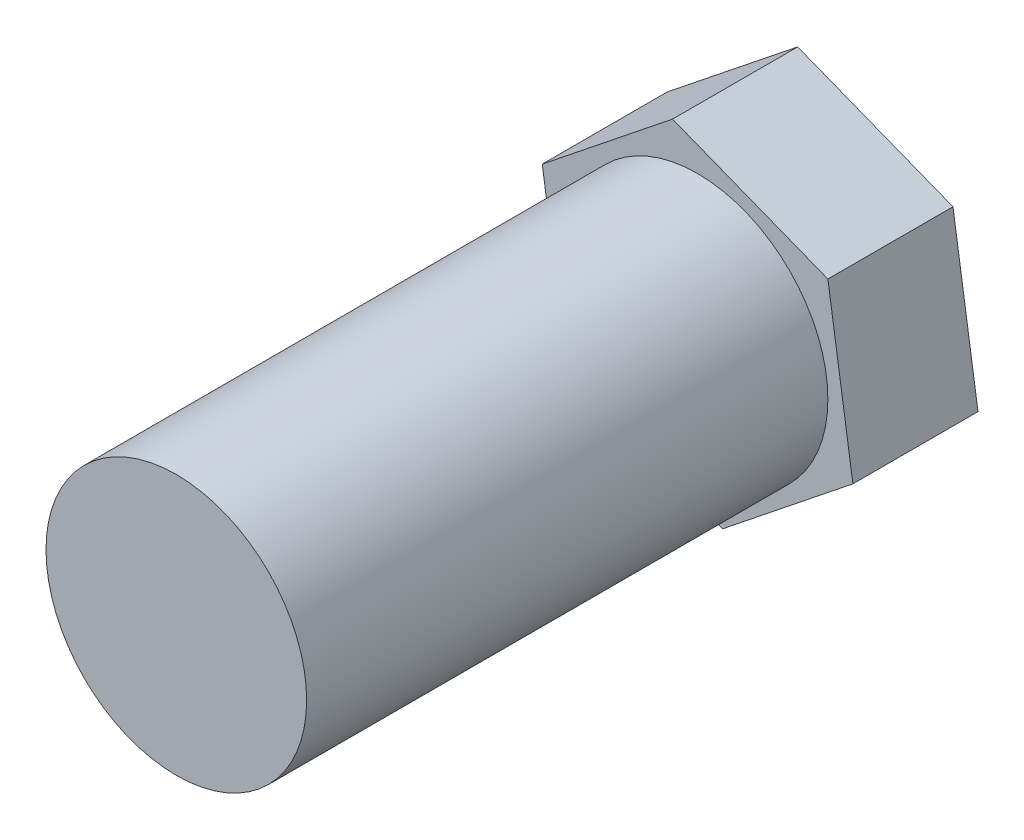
ISO-10303-21;
HEADER;
FILE_DESCRIPTION(('STEP AP214'),'2;1');
FILE_NAME('part.step','',(''),(''),'','','');
FILE_SCHEMA(('AUTOMOTIVE_DESIGN { 1 0 10303 214 1 1 1 1 }'));
ENDSEC;
DATA;
#1=APPLICATION_CONTEXT('core data for automotive mechanical design processes');
#2=APPLICATION_PROTOCOL_DEFINITION('international standard','automotive_design',2000,#1);
#3=PRODUCT_CONTEXT('',#1,'mechanical');
#4=PRODUCT('Part','Part','',(#3));
#5=PRODUCT_RELATED_PRODUCT_CATEGORY('part','',(#4));
#6=PRODUCT_DEFINITION_FORMATION('','',#4);
#7=PRODUCT_DEFINITION_CONTEXT('part definition',#1,'design');
#8=PRODUCT_DEFINITION('design','',#6,#7);
#9=PRODUCT_DEFINITION_SHAPE('','',#8);
#10=(LENGTH_UNIT() NAMED_UNIT(*) SI_UNIT(.MILLI.,.METRE.));
#11=(NAMED_UNIT(*) PLANE_ANGLE_UNIT() SI_UNIT($,.RADIAN.));
#12=(NAMED_UNIT(*) SI_UNIT($,.STERADIAN.) SOLID_ANGLE_UNIT());
#13=UNCERTAINTY_MEASURE_WITH_UNIT(LENGTH_MEASURE(1.E-05),#10,'distance_accuracy_value','');
#14=(GEOMETRIC_REPRESENTATION_CONTEXT(3) GLOBAL_UNCERTAINTY_ASSIGNED_CONTEXT((#13)) GLOBAL_UNIT_ASSIGNED_CONTEXT((#10,
#11,#12)) REPRESENTATION_CONTEXT('',''));
#15=CARTESIAN_POINT('',(0.,0.,0.));
#16=DIRECTION('',(0.,0.,1.));
#17=DIRECTION('',(1.,0.,0.));
#18=AXIS2_PLACEMENT_3D('',#15,#16,#17);
#19=CARTESIAN_POINT('',(0.,0.,25.));
#20=DIRECTION('',(0.,0.,-1.));
#21=DIRECTION('',(-1.,0.,0.));
#22=AXIS2_PLACEMENT_3D('',#19,#20,#21);
#23=CYLINDRICAL_SURFACE('',#22,6.25);
#24=CARTESIAN_POINT('',(0.,0.,25.));
#25=DIRECTION('',(0.,0.,1.));
#26=DIRECTION('',(1.,0.,0.));
#27=AXIS2_PLACEMENT_3D('',#24,#25,#26);
#28=CIRCLE('',#27,6.25);
#29=CARTESIAN_POINT('',(6.25,0.,25.));
#30=VERTEX_POINT('',#29);
#31=EDGE_CURVE('E11',#30,#30,#28,.T.);
#32=ORIENTED_EDGE('',*,*,#31,.F.);
#33=EDGE_LOOP('',(#32));
#34=FACE_BOUND('',#33,.T.);
#35=CARTESIAN_POINT('',(0.,0.,0.));
#36=DIRECTION('',(0.,0.,-1.));
#37=DIRECTION('',(-1.,0.,0.));
#38=AXIS2_PLACEMENT_3D('',#35,#36,#37);
#39=CIRCLE('',#38,6.25);
#40=CARTESIAN_POINT('',(-6.25,0.,0.));
#41=VERTEX_POINT('',#40);
#42=EDGE_CURVE('E39',#41,#41,#39,.T.);
#43=ORIENTED_EDGE('',*,*,#42,.F.);
#44=EDGE_LOOP('',(#43));
#45=FACE_BOUND('',#44,.T.);
#46=ADVANCED_FACE('F31',(#34,#45),#23,.T.);
#47=CARTESIAN_POINT('',(0.,0.,25.));
#48=DIRECTION('',(0.,0.,1.));
#49=DIRECTION('',(1.,0.,0.));
#50=AXIS2_PLACEMENT_3D('',#47,#48,#49);
#51=PLANE('',#50);
#52=ORIENTED_EDGE('',*,*,#31,.T.);
#53=EDGE_LOOP('',(#52));
#54=FACE_BOUND('',#53,.T.);
#55=ADVANCED_FACE('F140',(#54),#51,.T.);
#56=CARTESIAN_POINT('',(-1.20013378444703,7.90946767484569,0.));
#57=DIRECTION('',(0.,0.,-1.));
#58=DIRECTION('',(-1.,0.,0.));
#59=AXIS2_PLACEMENT_3D('',#56,#57,#58);
#60=PLANE('',#59);
#61=DIRECTION('',(0.781216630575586,0.624260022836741,0.));
#62=VECTOR('',#61,1.);
#63=CARTESIAN_POINT('',(-7.44986682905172,2.91538749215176,0.));
#64=LINE('',#63,#62);
#65=CARTESIAN_POINT('',(-7.44986682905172,2.91538749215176,0.));
#66=VERTEX_POINT('',#65);
#67=CARTESIAN_POINT('',(-1.20013378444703,7.90946767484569,0.));
#68=VERTEX_POINT('',#67);
#69=EDGE_CURVE('E116',#66,#68,#64,.T.);
#70=ORIENTED_EDGE('',*,*,#69,.F.);
#71=DIRECTION('',(-0.150016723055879,0.988683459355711,0.));
#72=VECTOR('',#71,1.);
#73=CARTESIAN_POINT('',(-6.24973304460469,-4.99408018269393,0.));
#74=LINE('',#73,#72);
#75=CARTESIAN_POINT('',(-6.24973304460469,-4.99408018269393,0.));
#76=VERTEX_POINT('',#75);
#77=EDGE_CURVE('E76',#76,#66,#74,.T.);
#78=ORIENTED_EDGE('',*,*,#77,.F.);
#79=DIRECTION('',(-0.931233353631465,0.364423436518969,0.));
#80=VECTOR('',#79,1.);
#81=CARTESIAN_POINT('',(1.20013378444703,-7.90946767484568,0.));
#82=LINE('',#81,#80);
#83=CARTESIAN_POINT('',(1.20013378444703,-7.90946767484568,0.));
#84=VERTEX_POINT('',#83);
#85=EDGE_CURVE('E70',#84,#76,#82,.T.);
#86=ORIENTED_EDGE('',*,*,#85,.F.);
#87=DIRECTION('',(-0.781216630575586,-0.624260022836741,0.));
#88=VECTOR('',#87,1.);
#89=CARTESIAN_POINT('',(7.44986682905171,-2.91538749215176,0.));
#90=LINE('',#89,#88);
#91=CARTESIAN_POINT('',(7.44986682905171,-2.91538749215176,0.));
#92=VERTEX_POINT('',#91);
#93=EDGE_CURVE('E106',#92,#84,#90,.T.);
#94=ORIENTED_EDGE('',*,*,#93,.F.);
#95=DIRECTION('',(0.150016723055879,-0.988683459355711,0.));
#96=VECTOR('',#95,1.);
#97=CARTESIAN_POINT('',(6.24973304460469,4.99408018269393,0.));
#98=LINE('',#97,#96);
#99=CARTESIAN_POINT('',(6.24973304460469,4.99408018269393,0.));
#100=VERTEX_POINT('',#99);
#101=EDGE_CURVE('E121',#100,#92,#98,.T.);
#102=ORIENTED_EDGE('',*,*,#101,.F.);
#103=DIRECTION('',(0.931233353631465,-0.36442343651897,0.));
#104=VECTOR('',#103,1.);
#105=CARTESIAN_POINT('',(-1.20013378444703,7.90946767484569,0.));
#106=LINE('',#105,#104);
#107=EDGE_CURVE('E119',#68,#100,#106,.T.);
#108=ORIENTED_EDGE('',*,*,#107,.F.);
#109=EDGE_LOOP('',(#70,#78,#86,#94,#102,#108));
#110=FACE_BOUND('',#109,.T.);
#111=ORIENTED_EDGE('',*,*,#42,.T.);
#112=EDGE_LOOP('',(#111));
#113=FACE_BOUND('',#112,.T.);
#114=ADVANCED_FACE('F137',(#110,#113),#60,.F.);
#115=CARTESIAN_POINT('',(-7.44986682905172,2.91538749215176,-6.));
#116=DIRECTION('',(0.624260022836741,-0.781216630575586,0.));
#117=DIRECTION('',(0.781216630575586,0.624260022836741,0.));
#118=AXIS2_PLACEMENT_3D('',#115,#116,#117);
#119=PLANE('',#118);
#120=ORIENTED_EDGE('',*,*,#69,.T.);
#121=DIRECTION('',(0.,0.,1.));
#122=VECTOR('',#121,1.);
#123=CARTESIAN_POINT('',(-1.20013378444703,7.90946767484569,-6.));
#124=LINE('',#123,#122);
#125=CARTESIAN_POINT('',(-1.20013378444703,7.90946767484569,-6.));
#126=VERTEX_POINT('',#125);
#127=EDGE_CURVE('E133',#126,#68,#124,.T.);
#128=ORIENTED_EDGE('',*,*,#127,.F.);
#129=DIRECTION('',(0.781216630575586,0.624260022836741,0.));
#130=VECTOR('',#129,1.);
#131=CARTESIAN_POINT('',(-7.44986682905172,2.91538749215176,-6.));
#132=LINE('',#131,#130);
#133=CARTESIAN_POINT('',(-7.44986682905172,2.91538749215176,-6.));
#134=VERTEX_POINT('',#133);
#135=EDGE_CURVE('E126',#134,#126,#132,.T.);
#136=ORIENTED_EDGE('',*,*,#135,.F.);
#137=DIRECTION('',(0.,0.,1.));
#138=VECTOR('',#137,1.);
#139=CARTESIAN_POINT('',(-7.44986682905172,2.91538749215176,-6.));
#140=LINE('',#139,#138);
#141=EDGE_CURVE('E112',#134,#66,#140,.T.);
#142=ORIENTED_EDGE('',*,*,#141,.T.);
#143=EDGE_LOOP('',(#120,#128,#136,#142));
#144=FACE_BOUND('',#143,.T.);
#145=ADVANCED_FACE('F150',(#144),#119,.F.);
#146=CARTESIAN_POINT('',(-1.20013378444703,7.90946767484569,-6.));
#147=DIRECTION('',(-0.36442343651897,-0.931233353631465,0.));
#148=DIRECTION('',(0.931233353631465,-0.36442343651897,0.));
#149=AXIS2_PLACEMENT_3D('',#146,#147,#148);
#150=PLANE('',#149);
#151=ORIENTED_EDGE('',*,*,#107,.T.);
#152=DIRECTION('',(0.,0.,1.));
#153=VECTOR('',#152,1.);
#154=CARTESIAN_POINT('',(6.24973304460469,4.99408018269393,-6.));
#155=LINE('',#154,#153);
#156=CARTESIAN_POINT('',(6.24973304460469,4.99408018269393,-6.));
#157=VERTEX_POINT('',#156);
#158=EDGE_CURVE('E130',#157,#100,#155,.T.);
#159=ORIENTED_EDGE('',*,*,#158,.F.);
#160=DIRECTION('',(0.931233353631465,-0.36442343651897,0.));
#161=VECTOR('',#160,1.);
#162=CARTESIAN_POINT('',(-1.20013378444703,7.90946767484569,-6.));
#163=LINE('',#162,#161);
#164=EDGE_CURVE('E85',#126,#157,#163,.T.);
#165=ORIENTED_EDGE('',*,*,#164,.F.);
#166=ORIENTED_EDGE('',*,*,#127,.T.);
#167=EDGE_LOOP('',(#151,#159,#165,#166));
#168=FACE_BOUND('',#167,.T.);
#169=ADVANCED_FACE('F156',(#168),#150,.F.);
#170=CARTESIAN_POINT('',(6.24973304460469,4.99408018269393,-6.));
#171=DIRECTION('',(-0.988683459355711,-0.150016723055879,0.));
#172=DIRECTION('',(0.150016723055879,-0.988683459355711,0.));
#173=AXIS2_PLACEMENT_3D('',#170,#171,#172);
#174=PLANE('',#173);
#175=ORIENTED_EDGE('',*,*,#101,.T.);
#176=DIRECTION('',(0.,0.,1.));
#177=VECTOR('',#176,1.);
#178=CARTESIAN_POINT('',(7.44986682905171,-2.91538749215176,-6.));
#179=LINE('',#178,#177);
#180=CARTESIAN_POINT('',(7.44986682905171,-2.91538749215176,-6.));
#181=VERTEX_POINT('',#180);
#182=EDGE_CURVE('E107',#181,#92,#179,.T.);
#183=ORIENTED_EDGE('',*,*,#182,.F.);
#184=DIRECTION('',(0.150016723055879,-0.988683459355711,0.));
#185=VECTOR('',#184,1.);
#186=CARTESIAN_POINT('',(6.24973304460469,4.99408018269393,-6.));
#187=LINE('',#186,#185);
#188=EDGE_CURVE('E98',#157,#181,#187,.T.);
#189=ORIENTED_EDGE('',*,*,#188,.F.);
#190=ORIENTED_EDGE('',*,*,#158,.T.);
#191=EDGE_LOOP('',(#175,#183,#189,#190));
#192=FACE_BOUND('',#191,.T.);
#193=ADVANCED_FACE('F160',(#192),#174,.F.);
#194=CARTESIAN_POINT('',(7.44986682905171,-2.91538749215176,-6.));
#195=DIRECTION('',(-0.624260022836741,0.781216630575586,0.));
#196=DIRECTION('',(-0.781216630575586,-0.624260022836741,0.));
#197=AXIS2_PLACEMENT_3D('',#194,#195,#196);
#198=PLANE('',#197);
#199=ORIENTED_EDGE('',*,*,#93,.T.);
#200=DIRECTION('',(0.,0.,1.));
#201=VECTOR('',#200,1.);
#202=CARTESIAN_POINT('',(1.20013378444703,-7.90946767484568,-6.));
#203=LINE('',#202,#201);
#204=CARTESIAN_POINT('',(1.20013378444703,-7.90946767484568,-6.));
#205=VERTEX_POINT('',#204);
#206=EDGE_CURVE('E103',#205,#84,#203,.T.);
#207=ORIENTED_EDGE('',*,*,#206,.F.);
#208=DIRECTION('',(-0.781216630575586,-0.624260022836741,0.));
#209=VECTOR('',#208,1.);
#210=CARTESIAN_POINT('',(7.44986682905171,-2.91538749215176,-6.));
#211=LINE('',#210,#209);
#212=EDGE_CURVE('E92',#181,#205,#211,.T.);
#213=ORIENTED_EDGE('',*,*,#212,.F.);
#214=ORIENTED_EDGE('',*,*,#182,.T.);
#215=EDGE_LOOP('',(#199,#207,#213,#214));
#216=FACE_BOUND('',#215,.T.);
#217=ADVANCED_FACE('F104',(#216),#198,.F.);
#218=CARTESIAN_POINT('',(1.20013378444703,-7.90946767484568,-6.));
#219=DIRECTION('',(0.364423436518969,0.931233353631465,0.));
#220=DIRECTION('',(-0.931233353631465,0.364423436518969,0.));
#221=AXIS2_PLACEMENT_3D('',#218,#219,#220);
#222=PLANE('',#221);
#223=ORIENTED_EDGE('',*,*,#85,.T.);
#224=DIRECTION('',(0.,0.,1.));
#225=VECTOR('',#224,1.);
#226=CARTESIAN_POINT('',(-6.24973304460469,-4.99408018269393,-6.));
#227=LINE('',#226,#225);
#228=CARTESIAN_POINT('',(-6.24973304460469,-4.99408018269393,-6.));
#229=VERTEX_POINT('',#228);
#230=EDGE_CURVE('E108',#229,#76,#227,.T.);
#231=ORIENTED_EDGE('',*,*,#230,.F.);
#232=DIRECTION('',(-0.931233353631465,0.364423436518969,0.));
#233=VECTOR('',#232,1.);
#234=CARTESIAN_POINT('',(1.20013378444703,-7.90946767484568,-6.));
#235=LINE('',#234,#233);
#236=EDGE_CURVE('E96',#205,#229,#235,.T.);
#237=ORIENTED_EDGE('',*,*,#236,.F.);
#238=ORIENTED_EDGE('',*,*,#206,.T.);
#239=EDGE_LOOP('',(#223,#231,#237,#238));
#240=FACE_BOUND('',#239,.T.);
#241=ADVANCED_FACE('F110',(#240),#222,.F.);
#242=CARTESIAN_POINT('',(-6.24973304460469,-4.99408018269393,-6.));
#243=DIRECTION('',(0.988683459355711,0.150016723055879,0.));
#244=DIRECTION('',(-0.150016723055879,0.988683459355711,0.));
#245=AXIS2_PLACEMENT_3D('',#242,#243,#244);
#246=PLANE('',#245);
#247=ORIENTED_EDGE('',*,*,#77,.T.);
#248=ORIENTED_EDGE('',*,*,#141,.F.);
#249=DIRECTION('',(-0.150016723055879,0.988683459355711,0.));
#250=VECTOR('',#249,1.);
#251=CARTESIAN_POINT('',(-6.24973304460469,-4.99408018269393,-6.));
#252=LINE('',#251,#250);
#253=EDGE_CURVE('E47',#229,#134,#252,.T.);
#254=ORIENTED_EDGE('',*,*,#253,.F.);
#255=ORIENTED_EDGE('',*,*,#230,.T.);
#256=EDGE_LOOP('',(#247,#248,#254,#255));
#257=FACE_BOUND('',#256,.T.);
#258=ADVANCED_FACE('F168',(#257),#246,.F.);
#259=CARTESIAN_POINT('',(-1.20013378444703,7.90946767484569,-6.));
#260=DIRECTION('',(0.,0.,-1.));
#261=DIRECTION('',(-1.,0.,0.));
#262=AXIS2_PLACEMENT_3D('',#259,#260,#261);
#263=PLANE('',#262);
#264=ORIENTED_EDGE('',*,*,#135,.T.);
#265=ORIENTED_EDGE('',*,*,#164,.T.);
#266=ORIENTED_EDGE('',*,*,#188,.T.);
#267=ORIENTED_EDGE('',*,*,#212,.T.);
#268=ORIENTED_EDGE('',*,*,#236,.T.);
#269=ORIENTED_EDGE('',*,*,#253,.T.);
#270=EDGE_LOOP('',(#264,#265,#266,#267,#268,#269));
#271=FACE_BOUND('',#270,.T.);
#272=ADVANCED_FACE('F94',(#271),#263,.T.);
#273=CLOSED_SHELL('',(#46,#55,#114,#145,#169,#193,#217,#241,#258,#272));
#274=MANIFOLD_SOLID_BREP('B2',#273);
#275=ADVANCED_BREP_SHAPE_REPRESENTATION('',(#18,#274),#14);
#276=SHAPE_DEFINITION_REPRESENTATION(#9,#275);
ENDSEC;
END-ISO-10303-21;
